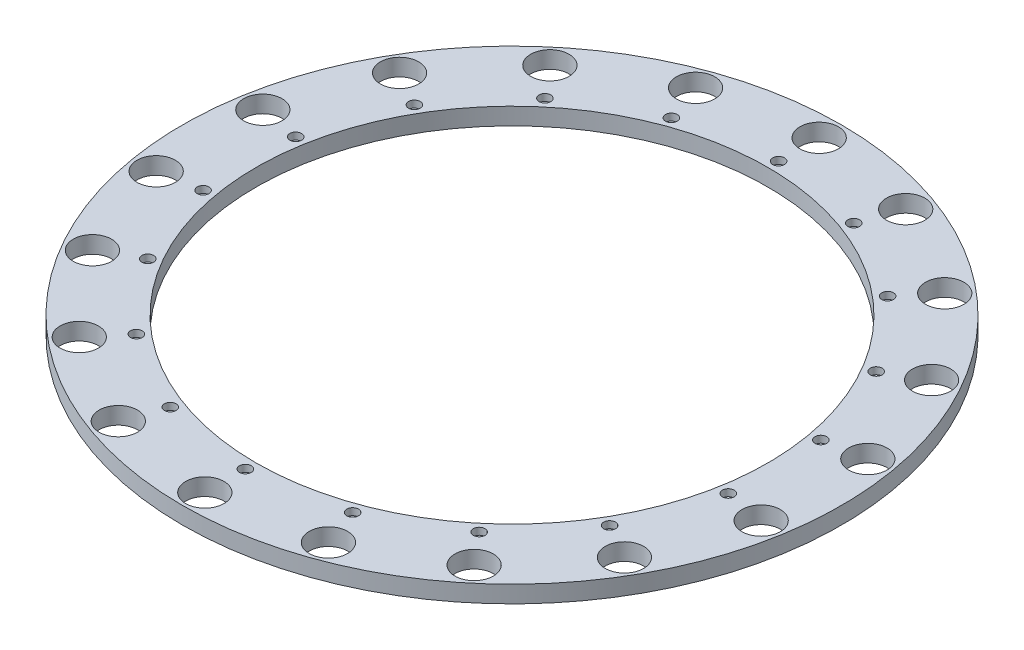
from build123d import *

# Parameters (mm, degrees)
SKETCH7_R           = 245.26875
SKETCH7_R_2         = 179.3875
BASE_EXTRUDE_DEPTH  = 12.7
SKETCH8_R           = 14.2875
IGLIDE_BORE_DEPTH   = 348.094813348
OF_PUNCHES_COUNT    = 18
CBORE_PATTERN_COUNT = 18
SKETCH18_R          = 190.5
CUT_EXTRUDE2_DEPTH  = 348.094813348


with BuildPart() as part:
    # Sketch7 → Base-Extrude (new body)
    with BuildSketch(Plane(origin=(0, 0, 0), x_dir=(1, 0, 0), z_dir=(0, 1, 0))):
        with Locations(Location((0, 0, 0), (0, 0, 270))):
            Circle(SKETCH7_R)
        with Locations(Location((0, 0, 0), (0, 0, 270))):
            Circle(SKETCH7_R_2, mode=Mode.SUBTRACT)
    extrude(amount=BASE_EXTRUDE_DEPTH)

    # Sketch11 → Cut-Revolve1 (revolve, cut)
    with BuildSketch(Plane(origin=(195.422788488, 0, -34.458310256), x_dir=(0, 0, 1), z_dir=(1, 0, 0)), mode=Mode.PRIVATE) as cut_revolve1_sk:
        Polygon((0, 0), (-3.9878, 0), (-3.9878, -3.175), (-2.8067, -3.175), (-2.8067, -192.0875), (0, -192.0875), align=None)
    cut_revolve1 = revolve(cut_revolve1_sk.sketch.rotate(Axis((195.422788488, 0, -34.458310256), (0, -1, 0)), 180), axis=Axis((195.422788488, 0, -34.458310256), (0, -1, 0)), mode=Mode.SUBTRACT)

    # Sketch17 → Cut-Revolve2 (revolve, cut)
    with BuildSketch(Plane(origin=(195.422788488, 12.7, -34.458310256), x_dir=(0, 0, 1), z_dir=(-1, 0, 0)), mode=Mode.PRIVATE) as cut_revolve2_sk:
        Polygon((0, 0), (-4.365625, 0), (-4.365625, -5.159375), (-2.8067, -5.159375), (-2.8067, -208.359375), (0, -208.359375), align=None)
    cut_revolve2 = revolve(cut_revolve2_sk.sketch.rotate(Axis((195.422788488, 12.7, -34.458310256), (0, 1, 0)), 180), axis=Axis((195.422788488, 12.7, -34.458310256), (0, 1, 0)), mode=Mode.SUBTRACT)

    # Sketch8 → IGLIDE BORE (cut, through all)
    with BuildSketch(Plane(origin=(0, 12.7, 0), x_dir=(-1, 0, 0), z_dir=(0, 1, 0))):
        with Locations((-225.127052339, -39.695973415)):
            Circle(SKETCH8_R)
    iglide_bore = extrude(amount=-IGLIDE_BORE_DEPTH, mode=Mode.SUBTRACT)

    # OF PUNCHES: Cut-Revolve1, IGLIDE BORE ×18 about axis
    of_punches_axis = Axis((0, 0, 0), (0, 1, 0))
    add([cut_revolve1.rotate(of_punches_axis, i * 360 / OF_PUNCHES_COUNT) for i in range(1, OF_PUNCHES_COUNT)], mode=Mode.SUBTRACT)
    add([iglide_bore.rotate(of_punches_axis, i * 360 / OF_PUNCHES_COUNT) for i in range(1, OF_PUNCHES_COUNT)], mode=Mode.SUBTRACT)

    # cbore pattern: Cut-Revolve2 ×18 about axis
    cbore_pattern_axis = Axis((0, 0, 0), (0, 1, 0))
    for i in range(1, CBORE_PATTERN_COUNT):
        add(cut_revolve2.rotate(cbore_pattern_axis, i * 360 / CBORE_PATTERN_COUNT), mode=Mode.SUBTRACT)

    # Sketch18 → Cut-Extrude2 (cut, through all)
    with BuildSketch(Plane(origin=(0, 0, 0), x_dir=(1, 0, 0), z_dir=(0, 1, 0))):
        with Locations(Location((0, 0, 0), (0, 0, 270))):
            Circle(SKETCH18_R)
    extrude(amount=CUT_EXTRUDE2_DEPTH, mode=Mode.SUBTRACT)


solid = part.part
